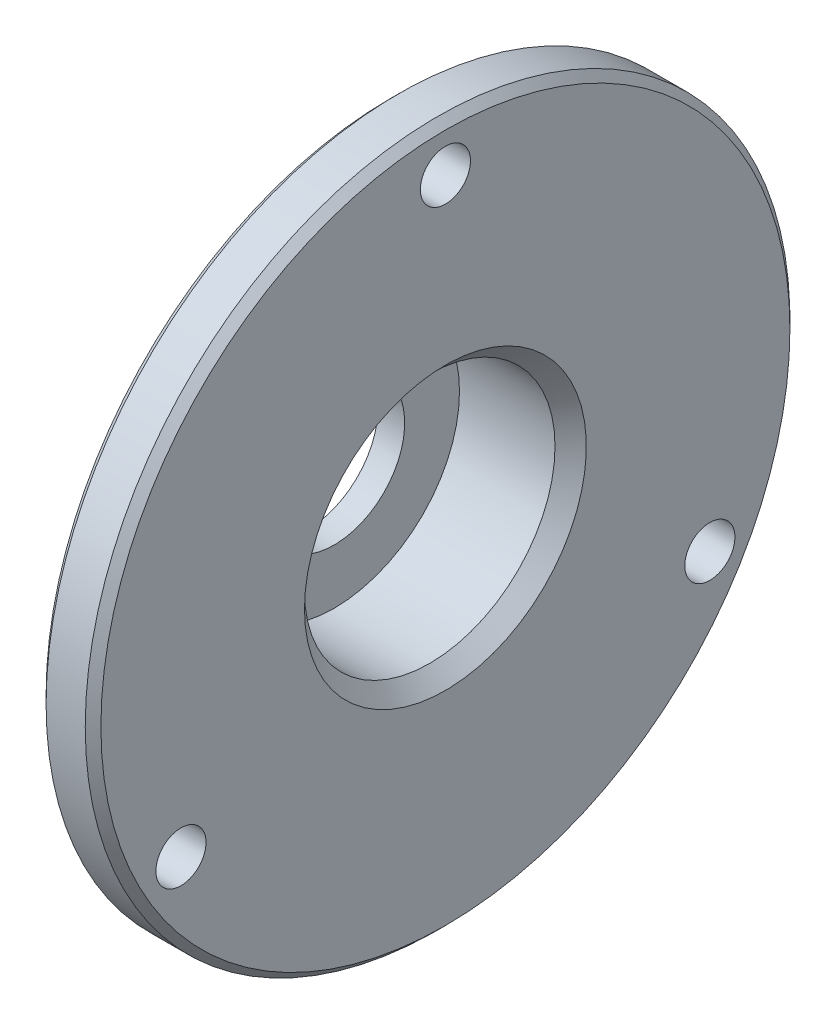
ISO-10303-21;
HEADER;
FILE_DESCRIPTION(('STEP AP214'),'2;1');
FILE_NAME('part.step','',(''),(''),'','','');
FILE_SCHEMA(('AUTOMOTIVE_DESIGN { 1 0 10303 214 1 1 1 1 }'));
ENDSEC;
DATA;
#1=APPLICATION_CONTEXT('core data for automotive mechanical design processes');
#2=APPLICATION_PROTOCOL_DEFINITION('international standard','automotive_design',2000,#1);
#3=PRODUCT_CONTEXT('',#1,'mechanical');
#4=PRODUCT('Part','Part','',(#3));
#5=PRODUCT_RELATED_PRODUCT_CATEGORY('part','',(#4));
#6=PRODUCT_DEFINITION_FORMATION('','',#4);
#7=PRODUCT_DEFINITION_CONTEXT('part definition',#1,'design');
#8=PRODUCT_DEFINITION('design','',#6,#7);
#9=PRODUCT_DEFINITION_SHAPE('','',#8);
#10=(LENGTH_UNIT() NAMED_UNIT(*) SI_UNIT(.MILLI.,.METRE.));
#11=(NAMED_UNIT(*) PLANE_ANGLE_UNIT() SI_UNIT($,.RADIAN.));
#12=(NAMED_UNIT(*) SI_UNIT($,.STERADIAN.) SOLID_ANGLE_UNIT());
#13=UNCERTAINTY_MEASURE_WITH_UNIT(LENGTH_MEASURE(1.E-05),#10,'distance_accuracy_value','');
#14=(GEOMETRIC_REPRESENTATION_CONTEXT(3) GLOBAL_UNCERTAINTY_ASSIGNED_CONTEXT((#13)) GLOBAL_UNIT_ASSIGNED_CONTEXT((#10,
#11,#12)) REPRESENTATION_CONTEXT('',''));
#15=CARTESIAN_POINT('',(0.,0.,0.));
#16=DIRECTION('',(0.,0.,1.));
#17=DIRECTION('',(1.,0.,0.));
#18=AXIS2_PLACEMENT_3D('',#15,#16,#17);
#19=CARTESIAN_POINT('',(0.,0.,0.));
#20=DIRECTION('',(-1.,0.,0.));
#21=DIRECTION('',(0.,0.,1.));
#22=AXIS2_PLACEMENT_3D('',#19,#20,#21);
#23=CYLINDRICAL_SURFACE('',#22,4.5);
#24=CARTESIAN_POINT('',(1.7,0.,0.));
#25=DIRECTION('',(-1.,0.,0.));
#26=DIRECTION('',(0.,0.,1.));
#27=AXIS2_PLACEMENT_3D('',#24,#25,#26);
#28=CIRCLE('',#27,4.5);
#29=CARTESIAN_POINT('',(1.7,0.,4.5));
#30=VERTEX_POINT('',#29);
#31=EDGE_CURVE('E56',#30,#30,#28,.T.);
#32=ORIENTED_EDGE('',*,*,#31,.F.);
#33=EDGE_LOOP('',(#32));
#34=FACE_BOUND('',#33,.T.);
#35=CARTESIAN_POINT('',(0.,0.,0.));
#36=DIRECTION('',(-1.,0.,0.));
#37=DIRECTION('',(0.,0.,1.));
#38=AXIS2_PLACEMENT_3D('',#35,#36,#37);
#39=CIRCLE('',#38,4.5);
#40=CARTESIAN_POINT('',(0.,0.,4.5));
#41=VERTEX_POINT('',#40);
#42=EDGE_CURVE('E69',#41,#41,#39,.T.);
#43=ORIENTED_EDGE('',*,*,#42,.T.);
#44=EDGE_LOOP('',(#43));
#45=FACE_BOUND('',#44,.T.);
#46=ADVANCED_FACE('F25',(#34,#45),#23,.F.);
#47=CARTESIAN_POINT('',(1.7,8.,0.));
#48=DIRECTION('',(-1.,0.,0.));
#49=DIRECTION('',(0.,0.,1.));
#50=AXIS2_PLACEMENT_3D('',#47,#48,#49);
#51=PLANE('',#50);
#52=CARTESIAN_POINT('',(1.7,0.,0.));
#53=DIRECTION('',(-1.,0.,0.));
#54=DIRECTION('',(0.,0.,1.));
#55=AXIS2_PLACEMENT_3D('',#52,#53,#54);
#56=CIRCLE('',#55,8.);
#57=CARTESIAN_POINT('',(1.7,0.,8.));
#58=VERTEX_POINT('',#57);
#59=EDGE_CURVE('E72',#58,#58,#56,.T.);
#60=ORIENTED_EDGE('',*,*,#59,.F.);
#61=EDGE_LOOP('',(#60));
#62=FACE_BOUND('',#61,.T.);
#63=ORIENTED_EDGE('',*,*,#31,.T.);
#64=EDGE_LOOP('',(#63));
#65=FACE_BOUND('',#64,.T.);
#66=ADVANCED_FACE('F125',(#62,#65),#51,.F.);
#67=CARTESIAN_POINT('',(0.,0.,0.));
#68=DIRECTION('',(-1.,0.,0.));
#69=DIRECTION('',(0.,0.,1.));
#70=AXIS2_PLACEMENT_3D('',#67,#68,#69);
#71=CYLINDRICAL_SURFACE('',#70,8.);
#72=CARTESIAN_POINT('',(7.79999999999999,0.,0.));
#73=DIRECTION('',(-1.,0.,0.));
#74=DIRECTION('',(0.,0.,1.));
#75=AXIS2_PLACEMENT_3D('',#72,#73,#74);
#76=CIRCLE('',#75,8.);
#77=CARTESIAN_POINT('',(7.79999999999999,0.,8.));
#78=VERTEX_POINT('',#77);
#79=EDGE_CURVE('E50',#78,#78,#76,.F.);
#80=ORIENTED_EDGE('',*,*,#79,.T.);
#81=EDGE_LOOP('',(#80));
#82=FACE_BOUND('',#81,.T.);
#83=ORIENTED_EDGE('',*,*,#59,.T.);
#84=EDGE_LOOP('',(#83));
#85=FACE_BOUND('',#84,.T.);
#86=ADVANCED_FACE('F94',(#82,#85),#71,.F.);
#87=CARTESIAN_POINT('',(8.8,22.5,0.));
#88=DIRECTION('',(-1.,0.,0.));
#89=DIRECTION('',(0.,0.,1.));
#90=AXIS2_PLACEMENT_3D('',#87,#88,#89);
#91=PLANE('',#90);
#92=CARTESIAN_POINT('',(8.8,0.,0.));
#93=DIRECTION('',(-1.,0.,0.));
#94=DIRECTION('',(0.,0.,1.));
#95=AXIS2_PLACEMENT_3D('',#92,#93,#94);
#96=CIRCLE('',#95,22.);
#97=CARTESIAN_POINT('',(8.8,0.,22.));
#98=VERTEX_POINT('',#97);
#99=EDGE_CURVE('E10',#98,#98,#96,.F.);
#100=ORIENTED_EDGE('',*,*,#99,.T.);
#101=EDGE_LOOP('',(#100));
#102=FACE_BOUND('',#101,.T.);
#103=CARTESIAN_POINT('',(8.8,0.,0.));
#104=DIRECTION('',(-1.,0.,0.));
#105=DIRECTION('',(0.,0.,1.));
#106=AXIS2_PLACEMENT_3D('',#103,#104,#105);
#107=CIRCLE('',#106,9.00000000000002);
#108=CARTESIAN_POINT('',(8.8,0.,9.00000000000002));
#109=VERTEX_POINT('',#108);
#110=EDGE_CURVE('E53',#109,#109,#107,.T.);
#111=ORIENTED_EDGE('',*,*,#110,.T.);
#112=EDGE_LOOP('',(#111));
#113=FACE_BOUND('',#112,.T.);
#114=CARTESIAN_POINT('',(8.8,-9.74999999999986,-16.8874953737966));
#115=DIRECTION('',(1.,0.,0.));
#116=DIRECTION('',(0.,-0.866025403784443,0.499999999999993));
#117=AXIS2_PLACEMENT_3D('',#114,#115,#116);
#118=CIRCLE('',#117,1.6);
#119=CARTESIAN_POINT('',(8.8,-11.135640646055,-16.0874953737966));
#120=VERTEX_POINT('',#119);
#121=EDGE_CURVE('E61',#120,#120,#118,.T.);
#122=ORIENTED_EDGE('',*,*,#121,.F.);
#123=EDGE_LOOP('',(#122));
#124=FACE_BOUND('',#123,.T.);
#125=CARTESIAN_POINT('',(8.8,-9.75000000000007,16.8874953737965));
#126=DIRECTION('',(1.,0.,0.));
#127=DIRECTION('',(0.,0.866025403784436,0.500000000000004));
#128=AXIS2_PLACEMENT_3D('',#125,#126,#127);
#129=CIRCLE('',#128,1.6);
#130=CARTESIAN_POINT('',(8.8,-8.36435935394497,17.6874953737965));
#131=VERTEX_POINT('',#130);
#132=EDGE_CURVE('E60',#131,#131,#129,.T.);
#133=ORIENTED_EDGE('',*,*,#132,.F.);
#134=EDGE_LOOP('',(#133));
#135=FACE_BOUND('',#134,.T.);
#136=CARTESIAN_POINT('',(8.8,19.5,0.));
#137=DIRECTION('',(1.,0.,0.));
#138=DIRECTION('',(0.,0.,-1.));
#139=AXIS2_PLACEMENT_3D('',#136,#137,#138);
#140=CIRCLE('',#139,1.6);
#141=CARTESIAN_POINT('',(8.8,19.5,-1.6));
#142=VERTEX_POINT('',#141);
#143=EDGE_CURVE('E65',#142,#142,#140,.T.);
#144=ORIENTED_EDGE('',*,*,#143,.F.);
#145=EDGE_LOOP('',(#144));
#146=FACE_BOUND('',#145,.T.);
#147=ADVANCED_FACE('F90',(#102,#113,#124,#135,#146),#91,.F.);
#148=CARTESIAN_POINT('',(0.,0.,0.));
#149=DIRECTION('',(-1.,0.,0.));
#150=DIRECTION('',(0.,0.,1.));
#151=AXIS2_PLACEMENT_3D('',#148,#149,#150);
#152=CYLINDRICAL_SURFACE('',#151,22.5);
#153=CARTESIAN_POINT('',(5.80000000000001,0.,0.));
#154=DIRECTION('',(1.,0.,0.));
#155=DIRECTION('',(0.,0.,-1.));
#156=AXIS2_PLACEMENT_3D('',#153,#154,#155);
#157=CIRCLE('',#156,22.5);
#158=CARTESIAN_POINT('',(5.80000000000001,0.,-22.5));
#159=VERTEX_POINT('',#158);
#160=EDGE_CURVE('E31',#159,#159,#157,.T.);
#161=ORIENTED_EDGE('',*,*,#160,.T.);
#162=EDGE_LOOP('',(#161));
#163=FACE_BOUND('',#162,.T.);
#164=CARTESIAN_POINT('',(8.29999999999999,0.,0.));
#165=DIRECTION('',(-1.,0.,0.));
#166=DIRECTION('',(0.,0.,1.));
#167=AXIS2_PLACEMENT_3D('',#164,#165,#166);
#168=CIRCLE('',#167,22.5);
#169=CARTESIAN_POINT('',(8.29999999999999,0.,22.5));
#170=VERTEX_POINT('',#169);
#171=EDGE_CURVE('E35',#170,#170,#168,.T.);
#172=ORIENTED_EDGE('',*,*,#171,.T.);
#173=EDGE_LOOP('',(#172));
#174=FACE_BOUND('',#173,.T.);
#175=ADVANCED_FACE('F93',(#163,#174),#152,.T.);
#176=CARTESIAN_POINT('',(5.3,11.9999999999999,0.));
#177=DIRECTION('',(1.,0.,0.));
#178=DIRECTION('',(0.,0.,-1.));
#179=AXIS2_PLACEMENT_3D('',#176,#177,#178);
#180=PLANE('',#179);
#181=CARTESIAN_POINT('',(5.3,0.,0.));
#182=DIRECTION('',(1.,0.,0.));
#183=DIRECTION('',(0.,0.,-1.));
#184=AXIS2_PLACEMENT_3D('',#181,#182,#183);
#185=CIRCLE('',#184,22.);
#186=CARTESIAN_POINT('',(5.3,0.,-22.));
#187=VERTEX_POINT('',#186);
#188=EDGE_CURVE('E39',#187,#187,#185,.F.);
#189=ORIENTED_EDGE('',*,*,#188,.T.);
#190=EDGE_LOOP('',(#189));
#191=FACE_BOUND('',#190,.T.);
#192=CARTESIAN_POINT('',(5.3,-9.74999999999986,-16.8874953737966));
#193=DIRECTION('',(1.,0.,0.));
#194=DIRECTION('',(0.,0.,-1.));
#195=AXIS2_PLACEMENT_3D('',#192,#193,#194);
#196=CIRCLE('',#195,1.6);
#197=CARTESIAN_POINT('',(5.3,-9.74999999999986,-18.4874953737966));
#198=VERTEX_POINT('',#197);
#199=EDGE_CURVE('E57',#198,#198,#196,.T.);
#200=ORIENTED_EDGE('',*,*,#199,.T.);
#201=EDGE_LOOP('',(#200));
#202=FACE_BOUND('',#201,.T.);
#203=CARTESIAN_POINT('',(5.3,-9.75000000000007,16.8874953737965));
#204=DIRECTION('',(1.,0.,0.));
#205=DIRECTION('',(0.,0.,-1.));
#206=AXIS2_PLACEMENT_3D('',#203,#204,#205);
#207=CIRCLE('',#206,1.6);
#208=CARTESIAN_POINT('',(5.3,-9.75000000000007,15.2874953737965));
#209=VERTEX_POINT('',#208);
#210=EDGE_CURVE('E62',#209,#209,#207,.T.);
#211=ORIENTED_EDGE('',*,*,#210,.T.);
#212=EDGE_LOOP('',(#211));
#213=FACE_BOUND('',#212,.T.);
#214=CARTESIAN_POINT('',(5.3,19.5,0.));
#215=DIRECTION('',(1.,0.,0.));
#216=DIRECTION('',(0.,0.,-1.));
#217=AXIS2_PLACEMENT_3D('',#214,#215,#216);
#218=CIRCLE('',#217,1.6);
#219=CARTESIAN_POINT('',(5.3,19.5,-1.6));
#220=VERTEX_POINT('',#219);
#221=EDGE_CURVE('E66',#220,#220,#218,.T.);
#222=ORIENTED_EDGE('',*,*,#221,.T.);
#223=EDGE_LOOP('',(#222));
#224=FACE_BOUND('',#223,.T.);
#225=CARTESIAN_POINT('',(5.3,0.,0.));
#226=DIRECTION('',(-1.,0.,0.));
#227=DIRECTION('',(0.,0.,1.));
#228=AXIS2_PLACEMENT_3D('',#225,#226,#227);
#229=CIRCLE('',#228,11.9999999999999);
#230=CARTESIAN_POINT('',(5.3,0.,11.9999999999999));
#231=VERTEX_POINT('',#230);
#232=EDGE_CURVE('E75',#231,#231,#229,.T.);
#233=ORIENTED_EDGE('',*,*,#232,.F.);
#234=EDGE_LOOP('',(#233));
#235=FACE_BOUND('',#234,.T.);
#236=ADVANCED_FACE('F108',(#191,#202,#213,#224,#235),#180,.F.);
#237=CARTESIAN_POINT('',(0.,0.,0.));
#238=DIRECTION('',(-1.,0.,0.));
#239=DIRECTION('',(0.,0.,1.));
#240=AXIS2_PLACEMENT_3D('',#237,#238,#239);
#241=CYLINDRICAL_SURFACE('',#240,11.9999999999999);
#242=CARTESIAN_POINT('',(0.500000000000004,0.,0.));
#243=DIRECTION('',(1.,0.,0.));
#244=DIRECTION('',(0.,0.,-1.));
#245=AXIS2_PLACEMENT_3D('',#242,#243,#244);
#246=CIRCLE('',#245,11.9999999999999);
#247=CARTESIAN_POINT('',(0.500000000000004,0.,-11.9999999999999));
#248=VERTEX_POINT('',#247);
#249=EDGE_CURVE('E44',#248,#248,#246,.T.);
#250=ORIENTED_EDGE('',*,*,#249,.T.);
#251=EDGE_LOOP('',(#250));
#252=FACE_BOUND('',#251,.T.);
#253=ORIENTED_EDGE('',*,*,#232,.T.);
#254=EDGE_LOOP('',(#253));
#255=FACE_BOUND('',#254,.T.);
#256=ADVANCED_FACE('F111',(#252,#255),#241,.T.);
#257=CARTESIAN_POINT('',(0.,4.5,0.));
#258=DIRECTION('',(1.,0.,0.));
#259=DIRECTION('',(0.,0.,-1.));
#260=AXIS2_PLACEMENT_3D('',#257,#258,#259);
#261=PLANE('',#260);
#262=CARTESIAN_POINT('',(0.,0.,0.));
#263=DIRECTION('',(1.,0.,0.));
#264=DIRECTION('',(0.,0.,-1.));
#265=AXIS2_PLACEMENT_3D('',#262,#263,#264);
#266=CIRCLE('',#265,11.4999999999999);
#267=CARTESIAN_POINT('',(0.,0.,-11.4999999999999));
#268=VERTEX_POINT('',#267);
#269=EDGE_CURVE('E47',#268,#268,#266,.F.);
#270=ORIENTED_EDGE('',*,*,#269,.T.);
#271=EDGE_LOOP('',(#270));
#272=FACE_BOUND('',#271,.T.);
#273=ORIENTED_EDGE('',*,*,#42,.F.);
#274=EDGE_LOOP('',(#273));
#275=FACE_BOUND('',#274,.T.);
#276=ADVANCED_FACE('F104',(#272,#275),#261,.F.);
#277=CARTESIAN_POINT('',(0.,19.5,0.));
#278=DIRECTION('',(1.,0.,0.));
#279=DIRECTION('',(0.,0.,-1.));
#280=AXIS2_PLACEMENT_3D('',#277,#278,#279);
#281=CYLINDRICAL_SURFACE('',#280,1.6);
#282=ORIENTED_EDGE('',*,*,#143,.T.);
#283=EDGE_LOOP('',(#282));
#284=FACE_BOUND('',#283,.T.);
#285=ORIENTED_EDGE('',*,*,#221,.F.);
#286=EDGE_LOOP('',(#285));
#287=FACE_BOUND('',#286,.T.);
#288=ADVANCED_FACE('F100',(#284,#287),#281,.F.);
#289=CARTESIAN_POINT('',(0.,-9.75000000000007,16.8874953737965));
#290=DIRECTION('',(1.,0.,0.));
#291=DIRECTION('',(0.,0.,-1.));
#292=AXIS2_PLACEMENT_3D('',#289,#290,#291);
#293=CYLINDRICAL_SURFACE('',#292,1.6);
#294=ORIENTED_EDGE('',*,*,#132,.T.);
#295=EDGE_LOOP('',(#294));
#296=FACE_BOUND('',#295,.T.);
#297=ORIENTED_EDGE('',*,*,#210,.F.);
#298=EDGE_LOOP('',(#297));
#299=FACE_BOUND('',#298,.T.);
#300=ADVANCED_FACE('F103',(#296,#299),#293,.F.);
#301=CARTESIAN_POINT('',(0.,-9.74999999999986,-16.8874953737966));
#302=DIRECTION('',(1.,0.,0.));
#303=DIRECTION('',(0.,0.,-1.));
#304=AXIS2_PLACEMENT_3D('',#301,#302,#303);
#305=CYLINDRICAL_SURFACE('',#304,1.6);
#306=ORIENTED_EDGE('',*,*,#121,.T.);
#307=EDGE_LOOP('',(#306));
#308=FACE_BOUND('',#307,.T.);
#309=ORIENTED_EDGE('',*,*,#199,.F.);
#310=EDGE_LOOP('',(#309));
#311=FACE_BOUND('',#310,.T.);
#312=ADVANCED_FACE('F87',(#308,#311),#305,.F.);
#313=CARTESIAN_POINT('',(8.8,0.,0.));
#314=DIRECTION('',(1.,0.,0.));
#315=DIRECTION('',(0.,0.,-1.));
#316=AXIS2_PLACEMENT_3D('',#313,#314,#315);
#317=CONICAL_SURFACE('',#316,9.00000000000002,0.785398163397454);
#318=ORIENTED_EDGE('',*,*,#79,.F.);
#319=EDGE_LOOP('',(#318));
#320=FACE_BOUND('',#319,.T.);
#321=ORIENTED_EDGE('',*,*,#110,.F.);
#322=EDGE_LOOP('',(#321));
#323=FACE_BOUND('',#322,.T.);
#324=ADVANCED_FACE('F163',(#320,#323),#317,.F.);
#325=CARTESIAN_POINT('',(0.,0.,0.));
#326=DIRECTION('',(1.,0.,0.));
#327=DIRECTION('',(0.,0.,-1.));
#328=AXIS2_PLACEMENT_3D('',#325,#326,#327);
#329=CONICAL_SURFACE('',#328,11.4999999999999,0.785398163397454);
#330=ORIENTED_EDGE('',*,*,#249,.F.);
#331=EDGE_LOOP('',(#330));
#332=FACE_BOUND('',#331,.T.);
#333=ORIENTED_EDGE('',*,*,#269,.F.);
#334=EDGE_LOOP('',(#333));
#335=FACE_BOUND('',#334,.T.);
#336=ADVANCED_FACE('F157',(#332,#335),#329,.T.);
#337=CARTESIAN_POINT('',(5.3,0.,0.));
#338=DIRECTION('',(1.,0.,0.));
#339=DIRECTION('',(0.,0.,-1.));
#340=AXIS2_PLACEMENT_3D('',#337,#338,#339);
#341=CONICAL_SURFACE('',#340,22.,0.785398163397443);
#342=ORIENTED_EDGE('',*,*,#160,.F.);
#343=EDGE_LOOP('',(#342));
#344=FACE_BOUND('',#343,.T.);
#345=ORIENTED_EDGE('',*,*,#188,.F.);
#346=EDGE_LOOP('',(#345));
#347=FACE_BOUND('',#346,.T.);
#348=ADVANCED_FACE('F151',(#344,#347),#341,.T.);
#349=CARTESIAN_POINT('',(8.29999999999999,0.,0.));
#350=DIRECTION('',(-1.,0.,0.));
#351=DIRECTION('',(0.,0.,1.));
#352=AXIS2_PLACEMENT_3D('',#349,#350,#351);
#353=CONICAL_SURFACE('',#352,22.5,0.785398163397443);
#354=ORIENTED_EDGE('',*,*,#99,.F.);
#355=EDGE_LOOP('',(#354));
#356=FACE_BOUND('',#355,.T.);
#357=ORIENTED_EDGE('',*,*,#171,.F.);
#358=EDGE_LOOP('',(#357));
#359=FACE_BOUND('',#358,.T.);
#360=ADVANCED_FACE('F149',(#356,#359),#353,.T.);
#361=CLOSED_SHELL('',(#46,#66,#86,#147,#175,#236,#256,#276,#288,#300,#312,#324,#336,#348,#360));
#362=MANIFOLD_SOLID_BREP('B2',#361);
#363=ADVANCED_BREP_SHAPE_REPRESENTATION('',(#18,#362),#14);
#364=SHAPE_DEFINITION_REPRESENTATION(#9,#363);
ENDSEC;
END-ISO-10303-21;
